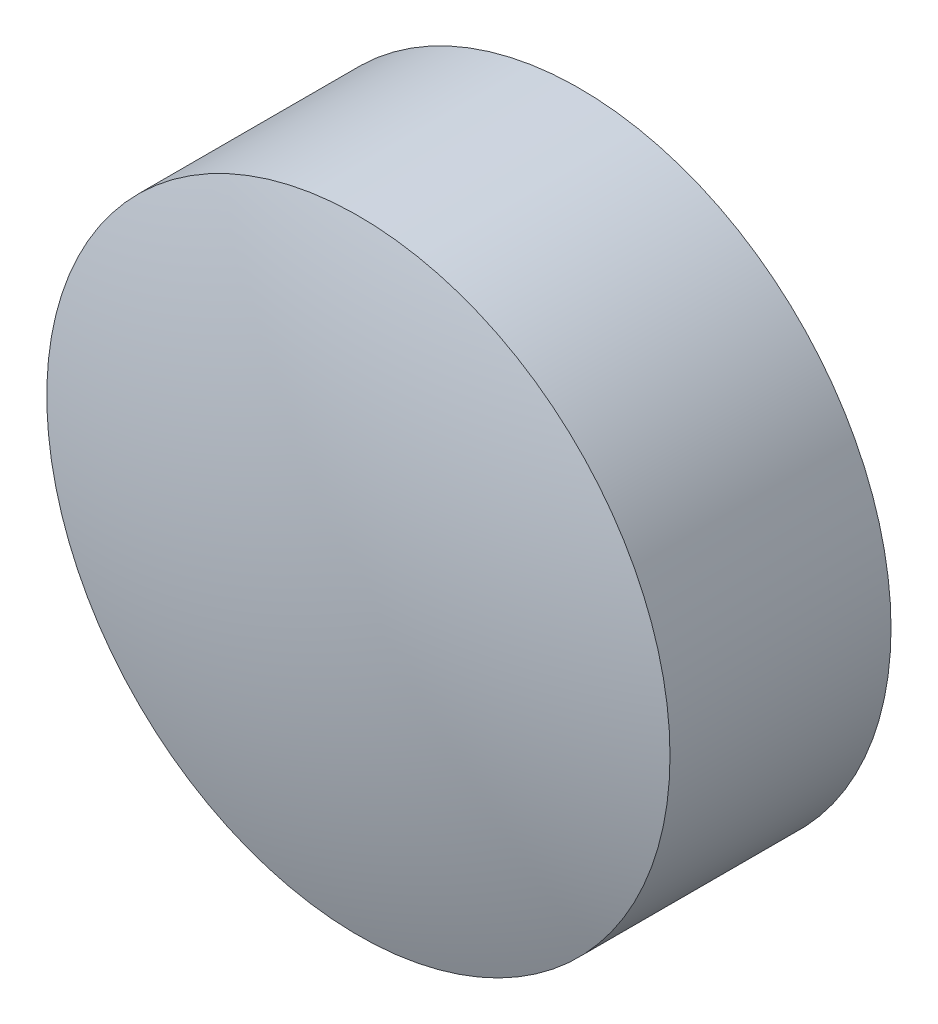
from build123d import *

# Parameters (mm, degrees)
SKETCH1_R           = 17
BOSS_EXTRUDE1_DEPTH = 12.057
DOME1_FACE_RADIUS   = 17
DOME1_HEIGHT        = 2.24
DOME2_FACE_RADIUS   = 17
DOME2_HEIGHT        = 2.63


with BuildPart() as part:
    # Sketch1 → Boss-Extrude1 (new body)
    with BuildSketch(Plane.XY):
        Circle(SKETCH1_R)
    extrude(amount=BOSS_EXTRUDE1_DEPTH)

    # Dome1: a dome of height H over a round flat face of radius A is a cap of a sphere of radius (A * A + H * H) / (2 * H)
    dome1_r = (DOME1_FACE_RADIUS * DOME1_FACE_RADIUS + DOME1_HEIGHT * DOME1_HEIGHT) / (2 * DOME1_HEIGHT)
    dome1_base = Plane((0, 0, 0), z_dir=(0, 0, -1))
    with Locations(dome1_base.offset(DOME1_HEIGHT - dome1_r)):
        dome1_ball = Sphere(dome1_r, mode=Mode.PRIVATE)
    add(split(dome1_ball, bisect_by=dome1_base, keep=Keep.TOP, mode=Mode.PRIVATE))

    # Dome2: a dome of height H over a round flat face of radius A is a cap of a sphere of radius (A * A + H * H) / (2 * H)
    dome2_r = (DOME2_FACE_RADIUS * DOME2_FACE_RADIUS + DOME2_HEIGHT * DOME2_HEIGHT) / (2 * DOME2_HEIGHT)
    dome2_base = Plane((0, 0, 12.057), z_dir=(0, 0, 1))
    with Locations(dome2_base.offset(DOME2_HEIGHT - dome2_r)):
        dome2_ball = Sphere(dome2_r, mode=Mode.PRIVATE)
    add(split(dome2_ball, bisect_by=dome2_base, keep=Keep.TOP, mode=Mode.PRIVATE))


solid = part.part
